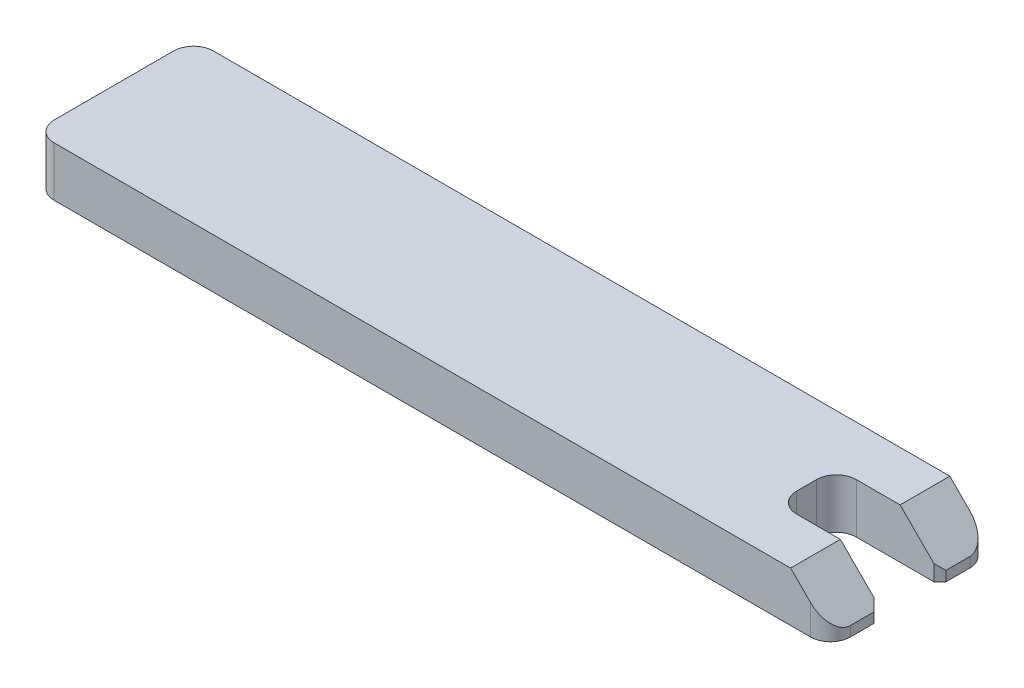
ISO-10303-21;
HEADER;
FILE_DESCRIPTION(('STEP AP214'),'2;1');
FILE_NAME('part.step','',(''),(''),'','','');
FILE_SCHEMA(('AUTOMOTIVE_DESIGN { 1 0 10303 214 1 1 1 1 }'));
ENDSEC;
DATA;
#1=APPLICATION_CONTEXT('core data for automotive mechanical design processes');
#2=APPLICATION_PROTOCOL_DEFINITION('international standard','automotive_design',2000,#1);
#3=PRODUCT_CONTEXT('',#1,'mechanical');
#4=PRODUCT('Part','Part','',(#3));
#5=PRODUCT_RELATED_PRODUCT_CATEGORY('part','',(#4));
#6=PRODUCT_DEFINITION_FORMATION('','',#4);
#7=PRODUCT_DEFINITION_CONTEXT('part definition',#1,'design');
#8=PRODUCT_DEFINITION('design','',#6,#7);
#9=PRODUCT_DEFINITION_SHAPE('','',#8);
#10=(LENGTH_UNIT() NAMED_UNIT(*) SI_UNIT(.MILLI.,.METRE.));
#11=(NAMED_UNIT(*) PLANE_ANGLE_UNIT() SI_UNIT($,.RADIAN.));
#12=(NAMED_UNIT(*) SI_UNIT($,.STERADIAN.) SOLID_ANGLE_UNIT());
#13=UNCERTAINTY_MEASURE_WITH_UNIT(LENGTH_MEASURE(1.E-05),#10,'distance_accuracy_value','');
#14=(GEOMETRIC_REPRESENTATION_CONTEXT(3) GLOBAL_UNCERTAINTY_ASSIGNED_CONTEXT((#13)) GLOBAL_UNIT_ASSIGNED_CONTEXT((#10,
#11,#12)) REPRESENTATION_CONTEXT('',''));
#15=CARTESIAN_POINT('',(0.,0.,0.));
#16=DIRECTION('',(0.,0.,1.));
#17=DIRECTION('',(1.,0.,0.));
#18=AXIS2_PLACEMENT_3D('',#15,#16,#17);
#19=CARTESIAN_POINT('',(-2.6,1.25,-1.5));
#20=DIRECTION('',(-1.,0.,0.));
#21=DIRECTION('',(0.,0.,1.));
#22=AXIS2_PLACEMENT_3D('',#19,#20,#21);
#23=PLANE('',#22);
#24=DIRECTION('',(0.,0.,-1.));
#25=VECTOR('',#24,1.);
#26=CARTESIAN_POINT('',(-2.6,1.25,-1.5));
#27=LINE('',#26,#25);
#28=CARTESIAN_POINT('',(-2.6,1.25,0.5));
#29=VERTEX_POINT('',#28);
#30=CARTESIAN_POINT('',(-2.6,1.25,-0.5));
#31=VERTEX_POINT('',#30);
#32=EDGE_CURVE('E183',#29,#31,#27,.T.);
#33=ORIENTED_EDGE('',*,*,#32,.F.);
#34=DIRECTION('',(0.,-1.,0.));
#35=VECTOR('',#34,1.);
#36=CARTESIAN_POINT('',(-2.6,-1.25,0.5));
#37=LINE('',#36,#35);
#38=CARTESIAN_POINT('',(-2.6,-1.25,0.5));
#39=VERTEX_POINT('',#38);
#40=EDGE_CURVE('E206',#29,#39,#37,.T.);
#41=ORIENTED_EDGE('',*,*,#40,.T.);
#42=DIRECTION('',(0.,0.,-1.));
#43=VECTOR('',#42,1.);
#44=CARTESIAN_POINT('',(-2.6,-1.25,-1.5));
#45=LINE('',#44,#43);
#46=CARTESIAN_POINT('',(-2.6,-1.25,-0.5));
#47=VERTEX_POINT('',#46);
#48=EDGE_CURVE('E301',#39,#47,#45,.T.);
#49=ORIENTED_EDGE('',*,*,#48,.T.);
#50=DIRECTION('',(0.,-1.,0.));
#51=VECTOR('',#50,1.);
#52=CARTESIAN_POINT('',(-2.6,1.25,-0.5));
#53=LINE('',#52,#51);
#54=EDGE_CURVE('E204',#47,#31,#53,.F.);
#55=ORIENTED_EDGE('',*,*,#54,.T.);
#56=EDGE_LOOP('',(#33,#41,#49,#55));
#57=FACE_BOUND('',#56,.T.);
#58=ADVANCED_FACE('F35',(#57),#23,.F.);
#59=CARTESIAN_POINT('',(-2.6,1.25,-1.5));
#60=DIRECTION('',(0.,0.,-1.));
#61=DIRECTION('',(-1.,0.,0.));
#62=AXIS2_PLACEMENT_3D('',#59,#60,#61);
#63=PLANE('',#62);
#64=DIRECTION('',(1.,0.,0.));
#65=VECTOR('',#64,1.);
#66=CARTESIAN_POINT('',(-2.6,-1.25,-1.5));
#67=LINE('',#66,#65);
#68=CARTESIAN_POINT('',(-1.6,-1.25,-1.5));
#69=VERTEX_POINT('',#68);
#70=CARTESIAN_POINT('',(2.3,-1.25,-1.5));
#71=VERTEX_POINT('',#70);
#72=EDGE_CURVE('E299',#69,#71,#67,.T.);
#73=ORIENTED_EDGE('',*,*,#72,.T.);
#74=DIRECTION('',(0.,1.,0.));
#75=VECTOR('',#74,1.);
#76=CARTESIAN_POINT('',(2.3,1.25,-1.5));
#77=LINE('',#76,#75);
#78=CARTESIAN_POINT('',(2.3,-0.450000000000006,-1.5));
#79=VERTEX_POINT('',#78);
#80=EDGE_CURVE('E166',#71,#79,#77,.T.);
#81=ORIENTED_EDGE('',*,*,#80,.T.);
#82=DIRECTION('',(-0.707106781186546,0.707106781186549,0.));
#83=VECTOR('',#82,1.);
#84=CARTESIAN_POINT('',(0.600000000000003,1.25,-1.5));
#85=LINE('',#84,#83);
#86=CARTESIAN_POINT('',(0.600000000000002,1.25,-1.5));
#87=VERTEX_POINT('',#86);
#88=EDGE_CURVE('E158',#79,#87,#85,.T.);
#89=ORIENTED_EDGE('',*,*,#88,.T.);
#90=DIRECTION('',(1.,0.,0.));
#91=VECTOR('',#90,1.);
#92=CARTESIAN_POINT('',(-2.6,1.25,-1.5));
#93=LINE('',#92,#91);
#94=CARTESIAN_POINT('',(-1.6,1.25,-1.5));
#95=VERTEX_POINT('',#94);
#96=EDGE_CURVE('E163',#95,#87,#93,.T.);
#97=ORIENTED_EDGE('',*,*,#96,.F.);
#98=DIRECTION('',(0.,-1.,0.));
#99=VECTOR('',#98,1.);
#100=CARTESIAN_POINT('',(-1.6,-1.25,-1.5));
#101=LINE('',#100,#99);
#102=EDGE_CURVE('E211',#95,#69,#101,.T.);
#103=ORIENTED_EDGE('',*,*,#102,.T.);
#104=EDGE_LOOP('',(#73,#81,#89,#97,#103));
#105=FACE_BOUND('',#104,.T.);
#106=ADVANCED_FACE('F161',(#105),#63,.F.);
#107=CARTESIAN_POINT('',(2.6,1.25,-1.5));
#108=DIRECTION('',(-1.,0.,0.));
#109=DIRECTION('',(0.,0.,1.));
#110=AXIS2_PLACEMENT_3D('',#107,#108,#109);
#111=PLANE('',#110);
#112=DIRECTION('',(0.,0.,1.));
#113=VECTOR('',#112,1.);
#114=CARTESIAN_POINT('',(2.6,-0.750000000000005,-1.5));
#115=LINE('',#114,#113);
#116=CARTESIAN_POINT('',(2.6,-0.750000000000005,-3.));
#117=VERTEX_POINT('',#116);
#118=CARTESIAN_POINT('',(2.6,-0.750000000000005,-1.8));
#119=VERTEX_POINT('',#118);
#120=EDGE_CURVE('E171',#117,#119,#115,.T.);
#121=ORIENTED_EDGE('',*,*,#120,.T.);
#122=DIRECTION('',(0.,-1.,0.));
#123=VECTOR('',#122,1.);
#124=CARTESIAN_POINT('',(2.6,1.25,-1.8));
#125=LINE('',#124,#123);
#126=CARTESIAN_POINT('',(2.6,-1.25,-1.8));
#127=VERTEX_POINT('',#126);
#128=EDGE_CURVE('E259',#119,#127,#125,.T.);
#129=ORIENTED_EDGE('',*,*,#128,.T.);
#130=DIRECTION('',(0.,0.,-1.));
#131=VECTOR('',#130,1.);
#132=CARTESIAN_POINT('',(2.6,-1.25,-1.5));
#133=LINE('',#132,#131);
#134=CARTESIAN_POINT('',(2.6,-1.25,-3.));
#135=VERTEX_POINT('',#134);
#136=EDGE_CURVE('E297',#127,#135,#133,.T.);
#137=ORIENTED_EDGE('',*,*,#136,.T.);
#138=DIRECTION('',(0.,-1.,0.));
#139=VECTOR('',#138,1.);
#140=CARTESIAN_POINT('',(2.6,1.25,-3.));
#141=LINE('',#140,#139);
#142=EDGE_CURVE('E227',#135,#117,#141,.F.);
#143=ORIENTED_EDGE('',*,*,#142,.T.);
#144=EDGE_LOOP('',(#121,#129,#137,#143));
#145=FACE_BOUND('',#144,.T.);
#146=ADVANCED_FACE('F348',(#145),#111,.F.);
#147=CARTESIAN_POINT('',(2.6,1.25,-3.99999999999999));
#148=DIRECTION('',(0.,0.,1.));
#149=DIRECTION('',(1.,0.,0.));
#150=AXIS2_PLACEMENT_3D('',#147,#148,#149);
#151=PLANE('',#150);
#152=DIRECTION('',(0.707106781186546,-0.707106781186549,0.));
#153=VECTOR('',#152,1.);
#154=CARTESIAN_POINT('',(0.600000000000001,1.25,-3.99999999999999));
#155=LINE('',#154,#153);
#156=CARTESIAN_POINT('',(0.599999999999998,1.25,-3.99999999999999));
#157=VERTEX_POINT('',#156);
#158=CARTESIAN_POINT('',(1.6,0.249999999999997,-3.99999999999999));
#159=VERTEX_POINT('',#158);
#160=EDGE_CURVE('E187',#157,#159,#155,.T.);
#161=ORIENTED_EDGE('',*,*,#160,.T.);
#162=DIRECTION('',(0.,-1.,0.));
#163=VECTOR('',#162,1.);
#164=CARTESIAN_POINT('',(1.6,1.25,-3.99999999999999));
#165=LINE('',#164,#163);
#166=CARTESIAN_POINT('',(1.6,-1.25,-3.99999999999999));
#167=VERTEX_POINT('',#166);
#168=EDGE_CURVE('E215',#159,#167,#165,.T.);
#169=ORIENTED_EDGE('',*,*,#168,.T.);
#170=DIRECTION('',(-1.,0.,0.));
#171=VECTOR('',#170,1.);
#172=CARTESIAN_POINT('',(2.6,-1.25,-3.99999999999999));
#173=LINE('',#172,#171);
#174=CARTESIAN_POINT('',(-36.4,-1.25,-4.));
#175=VERTEX_POINT('',#174);
#176=EDGE_CURVE('E294',#167,#175,#173,.T.);
#177=ORIENTED_EDGE('',*,*,#176,.T.);
#178=DIRECTION('',(0.,-1.,0.));
#179=VECTOR('',#178,1.);
#180=CARTESIAN_POINT('',(-36.4,1.25,-4.));
#181=LINE('',#180,#179);
#182=CARTESIAN_POINT('',(-36.4,1.25,-4.));
#183=VERTEX_POINT('',#182);
#184=EDGE_CURVE('E213',#175,#183,#181,.F.);
#185=ORIENTED_EDGE('',*,*,#184,.T.);
#186=DIRECTION('',(-1.,0.,0.));
#187=VECTOR('',#186,1.);
#188=CARTESIAN_POINT('',(2.6,1.25,-3.99999999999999));
#189=LINE('',#188,#187);
#190=EDGE_CURVE('E182',#157,#183,#189,.T.);
#191=ORIENTED_EDGE('',*,*,#190,.F.);
#192=EDGE_LOOP('',(#161,#169,#177,#185,#191));
#193=FACE_BOUND('',#192,.T.);
#194=ADVANCED_FACE('F355',(#193),#151,.F.);
#195=CARTESIAN_POINT('',(-37.4,1.25,-4.));
#196=DIRECTION('',(1.,0.,0.));
#197=DIRECTION('',(0.,0.,-1.));
#198=AXIS2_PLACEMENT_3D('',#195,#196,#197);
#199=PLANE('',#198);
#200=DIRECTION('',(0.,0.,1.));
#201=VECTOR('',#200,1.);
#202=CARTESIAN_POINT('',(-37.4,1.25,-4.));
#203=LINE('',#202,#201);
#204=CARTESIAN_POINT('',(-37.4,1.25,-3.));
#205=VERTEX_POINT('',#204);
#206=CARTESIAN_POINT('',(-37.4,1.25,3.));
#207=VERTEX_POINT('',#206);
#208=EDGE_CURVE('E308',#205,#207,#203,.T.);
#209=ORIENTED_EDGE('',*,*,#208,.F.);
#210=DIRECTION('',(0.,-1.,0.));
#211=VECTOR('',#210,1.);
#212=CARTESIAN_POINT('',(-37.4,1.25,-3.));
#213=LINE('',#212,#211);
#214=CARTESIAN_POINT('',(-37.4,-1.25,-3.));
#215=VERTEX_POINT('',#214);
#216=EDGE_CURVE('E244',#205,#215,#213,.T.);
#217=ORIENTED_EDGE('',*,*,#216,.T.);
#218=DIRECTION('',(0.,0.,1.));
#219=VECTOR('',#218,1.);
#220=CARTESIAN_POINT('',(-37.4,-1.25,-4.));
#221=LINE('',#220,#219);
#222=CARTESIAN_POINT('',(-37.4,-1.25,3.));
#223=VERTEX_POINT('',#222);
#224=EDGE_CURVE('E291',#215,#223,#221,.T.);
#225=ORIENTED_EDGE('',*,*,#224,.T.);
#226=DIRECTION('',(0.,-1.,0.));
#227=VECTOR('',#226,1.);
#228=CARTESIAN_POINT('',(-37.4,1.25,3.));
#229=LINE('',#228,#227);
#230=EDGE_CURVE('E242',#223,#207,#229,.F.);
#231=ORIENTED_EDGE('',*,*,#230,.T.);
#232=EDGE_LOOP('',(#209,#217,#225,#231));
#233=FACE_BOUND('',#232,.T.);
#234=ADVANCED_FACE('F320',(#233),#199,.F.);
#235=CARTESIAN_POINT('',(2.6,1.25,3.99999999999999));
#236=DIRECTION('',(0.,0.,-1.));
#237=DIRECTION('',(-1.,0.,0.));
#238=AXIS2_PLACEMENT_3D('',#235,#236,#237);
#239=PLANE('',#238);
#240=DIRECTION('',(1.,0.,0.));
#241=VECTOR('',#240,1.);
#242=CARTESIAN_POINT('',(2.6,-1.25,3.99999999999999));
#243=LINE('',#242,#241);
#244=CARTESIAN_POINT('',(-36.4,-1.25,4.));
#245=VERTEX_POINT('',#244);
#246=CARTESIAN_POINT('',(1.6,-1.25,3.99999999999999));
#247=VERTEX_POINT('',#246);
#248=EDGE_CURVE('E286',#245,#247,#243,.T.);
#249=ORIENTED_EDGE('',*,*,#248,.T.);
#250=DIRECTION('',(0.,-1.,0.));
#251=VECTOR('',#250,1.);
#252=CARTESIAN_POINT('',(1.6,1.25,3.99999999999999));
#253=LINE('',#252,#251);
#254=CARTESIAN_POINT('',(1.6,0.249999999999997,3.99999999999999));
#255=VERTEX_POINT('',#254);
#256=EDGE_CURVE('E237',#247,#255,#253,.F.);
#257=ORIENTED_EDGE('',*,*,#256,.T.);
#258=DIRECTION('',(-0.707106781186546,0.707106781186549,0.));
#259=VECTOR('',#258,1.);
#260=CARTESIAN_POINT('',(0.600000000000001,1.25,3.99999999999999));
#261=LINE('',#260,#259);
#262=CARTESIAN_POINT('',(0.599999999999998,1.25,3.99999999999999));
#263=VERTEX_POINT('',#262);
#264=EDGE_CURVE('E201',#255,#263,#261,.T.);
#265=ORIENTED_EDGE('',*,*,#264,.T.);
#266=DIRECTION('',(1.,0.,0.));
#267=VECTOR('',#266,1.);
#268=CARTESIAN_POINT('',(2.6,1.25,3.99999999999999));
#269=LINE('',#268,#267);
#270=CARTESIAN_POINT('',(-36.4,1.25,4.));
#271=VERTEX_POINT('',#270);
#272=EDGE_CURVE('E306',#271,#263,#269,.T.);
#273=ORIENTED_EDGE('',*,*,#272,.F.);
#274=DIRECTION('',(0.,-1.,0.));
#275=VECTOR('',#274,1.);
#276=CARTESIAN_POINT('',(-36.4,1.25,4.));
#277=LINE('',#276,#275);
#278=EDGE_CURVE('E234',#271,#245,#277,.T.);
#279=ORIENTED_EDGE('',*,*,#278,.T.);
#280=EDGE_LOOP('',(#249,#257,#265,#273,#279));
#281=FACE_BOUND('',#280,.T.);
#282=ADVANCED_FACE('F330',(#281),#239,.F.);
#283=CARTESIAN_POINT('',(2.6,1.25,1.5));
#284=DIRECTION('',(-1.,0.,0.));
#285=DIRECTION('',(0.,0.,1.));
#286=AXIS2_PLACEMENT_3D('',#283,#284,#285);
#287=PLANE('',#286);
#288=DIRECTION('',(0.,0.,-1.));
#289=VECTOR('',#288,1.);
#290=CARTESIAN_POINT('',(2.6,-1.25,1.5));
#291=LINE('',#290,#289);
#292=CARTESIAN_POINT('',(2.6,-1.25,3.));
#293=VERTEX_POINT('',#292);
#294=CARTESIAN_POINT('',(2.6,-1.25,1.79999999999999));
#295=VERTEX_POINT('',#294);
#296=EDGE_CURVE('E284',#293,#295,#291,.T.);
#297=ORIENTED_EDGE('',*,*,#296,.T.);
#298=DIRECTION('',(0.,1.,0.));
#299=VECTOR('',#298,1.);
#300=CARTESIAN_POINT('',(2.6,1.25,1.79999999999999));
#301=LINE('',#300,#299);
#302=CARTESIAN_POINT('',(2.6,-0.750000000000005,1.79999999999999));
#303=VERTEX_POINT('',#302);
#304=EDGE_CURVE('E43',#295,#303,#301,.T.);
#305=ORIENTED_EDGE('',*,*,#304,.T.);
#306=DIRECTION('',(0.,0.,1.));
#307=VECTOR('',#306,1.);
#308=CARTESIAN_POINT('',(2.6,-0.750000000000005,3.99999999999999));
#309=LINE('',#308,#307);
#310=CARTESIAN_POINT('',(2.6,-0.750000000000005,3.));
#311=VERTEX_POINT('',#310);
#312=EDGE_CURVE('E199',#303,#311,#309,.T.);
#313=ORIENTED_EDGE('',*,*,#312,.T.);
#314=DIRECTION('',(0.,-1.,0.));
#315=VECTOR('',#314,1.);
#316=CARTESIAN_POINT('',(2.6,1.25,3.));
#317=LINE('',#316,#315);
#318=EDGE_CURVE('E231',#311,#293,#317,.T.);
#319=ORIENTED_EDGE('',*,*,#318,.T.);
#320=EDGE_LOOP('',(#297,#305,#313,#319));
#321=FACE_BOUND('',#320,.T.);
#322=ADVANCED_FACE('F432',(#321),#287,.F.);
#323=CARTESIAN_POINT('',(-2.6,1.25,1.5));
#324=DIRECTION('',(0.,0.,1.));
#325=DIRECTION('',(1.,0.,0.));
#326=AXIS2_PLACEMENT_3D('',#323,#324,#325);
#327=PLANE('',#326);
#328=DIRECTION('',(0.707106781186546,-0.707106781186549,0.));
#329=VECTOR('',#328,1.);
#330=CARTESIAN_POINT('',(0.600000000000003,1.25,1.5));
#331=LINE('',#330,#329);
#332=CARTESIAN_POINT('',(0.600000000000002,1.25,1.5));
#333=VERTEX_POINT('',#332);
#334=CARTESIAN_POINT('',(2.30000000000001,-0.450000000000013,1.5));
#335=VERTEX_POINT('',#334);
#336=EDGE_CURVE('E170',#333,#335,#331,.T.);
#337=ORIENTED_EDGE('',*,*,#336,.T.);
#338=DIRECTION('',(0.,-1.,0.));
#339=VECTOR('',#338,1.);
#340=CARTESIAN_POINT('',(2.30000000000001,1.25,1.5));
#341=LINE('',#340,#339);
#342=CARTESIAN_POINT('',(2.30000000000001,-1.25,1.5));
#343=VERTEX_POINT('',#342);
#344=EDGE_CURVE('E269',#335,#343,#341,.T.);
#345=ORIENTED_EDGE('',*,*,#344,.T.);
#346=DIRECTION('',(-1.,0.,0.));
#347=VECTOR('',#346,1.);
#348=CARTESIAN_POINT('',(-2.6,-1.25,1.5));
#349=LINE('',#348,#347);
#350=CARTESIAN_POINT('',(-1.6,-1.25,1.5));
#351=VERTEX_POINT('',#350);
#352=EDGE_CURVE('E275',#343,#351,#349,.T.);
#353=ORIENTED_EDGE('',*,*,#352,.T.);
#354=DIRECTION('',(0.,-1.,0.));
#355=VECTOR('',#354,1.);
#356=CARTESIAN_POINT('',(-1.6,1.25,1.5));
#357=LINE('',#356,#355);
#358=CARTESIAN_POINT('',(-1.6,1.25,1.5));
#359=VERTEX_POINT('',#358);
#360=EDGE_CURVE('E209',#351,#359,#357,.F.);
#361=ORIENTED_EDGE('',*,*,#360,.T.);
#362=DIRECTION('',(-1.,0.,0.));
#363=VECTOR('',#362,1.);
#364=CARTESIAN_POINT('',(-2.6,1.25,1.5));
#365=LINE('',#364,#363);
#366=EDGE_CURVE('E192',#333,#359,#365,.T.);
#367=ORIENTED_EDGE('',*,*,#366,.F.);
#368=EDGE_LOOP('',(#337,#345,#353,#361,#367));
#369=FACE_BOUND('',#368,.T.);
#370=ADVANCED_FACE('F274',(#369),#327,.F.);
#371=CARTESIAN_POINT('',(0.,1.25,0.));
#372=DIRECTION('',(0.,1.,0.));
#373=DIRECTION('',(0.,0.,1.));
#374=AXIS2_PLACEMENT_3D('',#371,#372,#373);
#375=PLANE('',#374);
#376=ORIENTED_EDGE('',*,*,#190,.T.);
#377=CARTESIAN_POINT('',(-36.4,1.25,-3.));
#378=DIRECTION('',(0.,1.,0.));
#379=DIRECTION('',(0.,0.,1.));
#380=AXIS2_PLACEMENT_3D('',#377,#378,#379);
#381=CIRCLE('',#380,1.);
#382=EDGE_CURVE('E249',#183,#205,#381,.T.);
#383=ORIENTED_EDGE('',*,*,#382,.T.);
#384=ORIENTED_EDGE('',*,*,#208,.T.);
#385=CARTESIAN_POINT('',(-36.4,1.25,3.));
#386=DIRECTION('',(0.,1.,0.));
#387=DIRECTION('',(0.,0.,1.));
#388=AXIS2_PLACEMENT_3D('',#385,#386,#387);
#389=CIRCLE('',#388,1.);
#390=EDGE_CURVE('E247',#207,#271,#389,.T.);
#391=ORIENTED_EDGE('',*,*,#390,.T.);
#392=ORIENTED_EDGE('',*,*,#272,.T.);
#393=DIRECTION('',(0.,0.,-1.));
#394=VECTOR('',#393,1.);
#395=CARTESIAN_POINT('',(0.600000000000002,1.25,1.5));
#396=LINE('',#395,#394);
#397=EDGE_CURVE('E188',#263,#333,#396,.T.);
#398=ORIENTED_EDGE('',*,*,#397,.T.);
#399=ORIENTED_EDGE('',*,*,#366,.T.);
#400=CARTESIAN_POINT('',(-1.6,1.25,0.5));
#401=DIRECTION('',(0.,1.,0.));
#402=DIRECTION('',(0.,0.,1.));
#403=AXIS2_PLACEMENT_3D('',#400,#401,#402);
#404=CIRCLE('',#403,1.);
#405=EDGE_CURVE('E254',#359,#29,#404,.F.);
#406=ORIENTED_EDGE('',*,*,#405,.T.);
#407=ORIENTED_EDGE('',*,*,#32,.T.);
#408=CARTESIAN_POINT('',(-1.6,1.25,-0.5));
#409=DIRECTION('',(0.,1.,0.));
#410=DIRECTION('',(0.,0.,1.));
#411=AXIS2_PLACEMENT_3D('',#408,#409,#410);
#412=CIRCLE('',#411,1.);
#413=EDGE_CURVE('E181',#31,#95,#412,.F.);
#414=ORIENTED_EDGE('',*,*,#413,.T.);
#415=ORIENTED_EDGE('',*,*,#96,.T.);
#416=DIRECTION('',(0.,0.,-1.));
#417=VECTOR('',#416,1.);
#418=CARTESIAN_POINT('',(0.599999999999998,1.25,-3.99999999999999));
#419=LINE('',#418,#417);
#420=EDGE_CURVE('E177',#87,#157,#419,.T.);
#421=ORIENTED_EDGE('',*,*,#420,.T.);
#422=EDGE_LOOP('',(#376,#383,#384,#391,#392,#398,#399,#406,#407,#414,#415,#421));
#423=FACE_BOUND('',#422,.T.);
#424=ADVANCED_FACE('F176',(#423),#375,.T.);
#425=CARTESIAN_POINT('',(0.,-1.25,0.));
#426=DIRECTION('',(0.,1.,0.));
#427=DIRECTION('',(0.,0.,1.));
#428=AXIS2_PLACEMENT_3D('',#425,#426,#427);
#429=PLANE('',#428);
#430=ORIENTED_EDGE('',*,*,#136,.F.);
#431=DIRECTION('',(0.707106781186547,0.,-0.707106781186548));
#432=VECTOR('',#431,1.);
#433=CARTESIAN_POINT('',(2.6,-1.25,-1.8));
#434=LINE('',#433,#432);
#435=EDGE_CURVE('E264',#127,#71,#434,.F.);
#436=ORIENTED_EDGE('',*,*,#435,.T.);
#437=ORIENTED_EDGE('',*,*,#72,.F.);
#438=CARTESIAN_POINT('',(-1.6,-1.25,-0.5));
#439=DIRECTION('',(0.,1.,0.));
#440=DIRECTION('',(0.,0.,1.));
#441=AXIS2_PLACEMENT_3D('',#438,#439,#440);
#442=CIRCLE('',#441,1.);
#443=EDGE_CURVE('E256',#69,#47,#442,.T.);
#444=ORIENTED_EDGE('',*,*,#443,.T.);
#445=ORIENTED_EDGE('',*,*,#48,.F.);
#446=CARTESIAN_POINT('',(-1.6,-1.25,0.5));
#447=DIRECTION('',(0.,1.,0.));
#448=DIRECTION('',(0.,0.,1.));
#449=AXIS2_PLACEMENT_3D('',#446,#447,#448);
#450=CIRCLE('',#449,1.);
#451=EDGE_CURVE('E251',#39,#351,#450,.T.);
#452=ORIENTED_EDGE('',*,*,#451,.T.);
#453=ORIENTED_EDGE('',*,*,#352,.F.);
#454=DIRECTION('',(-0.707106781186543,0.,-0.707106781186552));
#455=VECTOR('',#454,1.);
#456=CARTESIAN_POINT('',(2.30000000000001,-1.25,1.5));
#457=LINE('',#456,#455);
#458=EDGE_CURVE('E262',#343,#295,#457,.F.);
#459=ORIENTED_EDGE('',*,*,#458,.T.);
#460=ORIENTED_EDGE('',*,*,#296,.F.);
#461=CARTESIAN_POINT('',(1.6,-1.25,2.99999999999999));
#462=DIRECTION('',(0.,1.,0.));
#463=DIRECTION('',(0.,0.,1.));
#464=AXIS2_PLACEMENT_3D('',#461,#462,#463);
#465=CIRCLE('',#464,1.);
#466=EDGE_CURVE('E222',#293,#247,#465,.F.);
#467=ORIENTED_EDGE('',*,*,#466,.T.);
#468=ORIENTED_EDGE('',*,*,#248,.F.);
#469=CARTESIAN_POINT('',(-36.4,-1.25,3.));
#470=DIRECTION('',(0.,1.,0.));
#471=DIRECTION('',(0.,0.,1.));
#472=AXIS2_PLACEMENT_3D('',#469,#470,#471);
#473=CIRCLE('',#472,1.);
#474=EDGE_CURVE('E218',#245,#223,#473,.F.);
#475=ORIENTED_EDGE('',*,*,#474,.T.);
#476=ORIENTED_EDGE('',*,*,#224,.F.);
#477=CARTESIAN_POINT('',(-36.4,-1.25,-3.));
#478=DIRECTION('',(0.,1.,0.));
#479=DIRECTION('',(0.,0.,1.));
#480=AXIS2_PLACEMENT_3D('',#477,#478,#479);
#481=CIRCLE('',#480,1.);
#482=EDGE_CURVE('E220',#215,#175,#481,.F.);
#483=ORIENTED_EDGE('',*,*,#482,.T.);
#484=ORIENTED_EDGE('',*,*,#176,.F.);
#485=CARTESIAN_POINT('',(1.6,-1.25,-2.99999999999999));
#486=DIRECTION('',(0.,1.,0.));
#487=DIRECTION('',(0.,0.,1.));
#488=AXIS2_PLACEMENT_3D('',#485,#486,#487);
#489=CIRCLE('',#488,1.);
#490=EDGE_CURVE('E224',#167,#135,#489,.F.);
#491=ORIENTED_EDGE('',*,*,#490,.T.);
#492=EDGE_LOOP('',(#430,#436,#437,#444,#445,#452,#453,#459,#460,#467,#468,#475,#476,#483,#484,#491));
#493=FACE_BOUND('',#492,.T.);
#494=ADVANCED_FACE('F280',(#493),#429,.F.);
#495=CARTESIAN_POINT('',(0.600000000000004,1.25,0.));
#496=DIRECTION('',(0.707106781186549,0.707106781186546,0.));
#497=DIRECTION('',(0.,0.,1.));
#498=AXIS2_PLACEMENT_3D('',#495,#496,#497);
#499=PLANE('',#498);
#500=ORIENTED_EDGE('',*,*,#88,.F.);
#501=DIRECTION('',(-0.577350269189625,0.577350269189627,0.577350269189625));
#502=VECTOR('',#501,1.);
#503=CARTESIAN_POINT('',(0.666666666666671,1.18333333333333,0.133333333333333));
#504=LINE('',#503,#502);
#505=EDGE_CURVE('E267',#79,#119,#504,.F.);
#506=ORIENTED_EDGE('',*,*,#505,.T.);
#507=ORIENTED_EDGE('',*,*,#120,.F.);
#508=CARTESIAN_POINT('',(1.6,0.249999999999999,-2.99999999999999));
#509=DIRECTION('',(0.707106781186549,0.707106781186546,0.));
#510=DIRECTION('',(0.707106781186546,-0.707106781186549,0.));
#511=AXIS2_PLACEMENT_3D('',#508,#509,#510);
#512=ELLIPSE('',#511,1.4142135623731,1.);
#513=EDGE_CURVE('E229',#117,#159,#512,.T.);
#514=ORIENTED_EDGE('',*,*,#513,.T.);
#515=ORIENTED_EDGE('',*,*,#160,.F.);
#516=ORIENTED_EDGE('',*,*,#420,.F.);
#517=EDGE_LOOP('',(#500,#506,#507,#514,#515,#516));
#518=FACE_BOUND('',#517,.T.);
#519=ADVANCED_FACE('F185',(#518),#499,.T.);
#520=CARTESIAN_POINT('',(0.600000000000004,1.25,0.));
#521=DIRECTION('',(0.707106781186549,0.707106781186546,0.));
#522=DIRECTION('',(0.,0.,1.));
#523=AXIS2_PLACEMENT_3D('',#520,#521,#522);
#524=PLANE('',#523);
#525=ORIENTED_EDGE('',*,*,#312,.F.);
#526=DIRECTION('',(0.577350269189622,-0.577350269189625,0.57735026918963));
#527=VECTOR('',#526,1.);
#528=CARTESIAN_POINT('',(0.66666666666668,1.18333333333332,-0.13333333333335));
#529=LINE('',#528,#527);
#530=EDGE_CURVE('E11',#303,#335,#529,.F.);
#531=ORIENTED_EDGE('',*,*,#530,.T.);
#532=ORIENTED_EDGE('',*,*,#336,.F.);
#533=ORIENTED_EDGE('',*,*,#397,.F.);
#534=ORIENTED_EDGE('',*,*,#264,.F.);
#535=CARTESIAN_POINT('',(1.6,0.249999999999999,2.99999999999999));
#536=DIRECTION('',(0.707106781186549,0.707106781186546,0.));
#537=DIRECTION('',(0.707106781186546,-0.707106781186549,0.));
#538=AXIS2_PLACEMENT_3D('',#535,#536,#537);
#539=ELLIPSE('',#538,1.4142135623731,1.);
#540=EDGE_CURVE('E239',#255,#311,#539,.T.);
#541=ORIENTED_EDGE('',*,*,#540,.T.);
#542=EDGE_LOOP('',(#525,#531,#532,#533,#534,#541));
#543=FACE_BOUND('',#542,.T.);
#544=ADVANCED_FACE('F373',(#543),#524,.T.);
#545=CARTESIAN_POINT('',(-1.6,1.25,0.5));
#546=DIRECTION('',(0.,1.,0.));
#547=DIRECTION('',(0.,0.,1.));
#548=AXIS2_PLACEMENT_3D('',#545,#546,#547);
#549=CYLINDRICAL_SURFACE('',#548,1.);
#550=ORIENTED_EDGE('',*,*,#405,.F.);
#551=ORIENTED_EDGE('',*,*,#360,.F.);
#552=ORIENTED_EDGE('',*,*,#451,.F.);
#553=ORIENTED_EDGE('',*,*,#40,.F.);
#554=EDGE_LOOP('',(#550,#551,#552,#553));
#555=FACE_BOUND('',#554,.T.);
#556=ADVANCED_FACE('F336',(#555),#549,.F.);
#557=CARTESIAN_POINT('',(-1.6,1.25,-0.5));
#558=DIRECTION('',(0.,1.,0.));
#559=DIRECTION('',(0.,0.,1.));
#560=AXIS2_PLACEMENT_3D('',#557,#558,#559);
#561=CYLINDRICAL_SURFACE('',#560,1.);
#562=ORIENTED_EDGE('',*,*,#413,.F.);
#563=ORIENTED_EDGE('',*,*,#54,.F.);
#564=ORIENTED_EDGE('',*,*,#443,.F.);
#565=ORIENTED_EDGE('',*,*,#102,.F.);
#566=EDGE_LOOP('',(#562,#563,#564,#565));
#567=FACE_BOUND('',#566,.T.);
#568=ADVANCED_FACE('F342',(#567),#561,.F.);
#569=CARTESIAN_POINT('',(1.6,1.25,-2.99999999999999));
#570=DIRECTION('',(0.,-1.,0.));
#571=DIRECTION('',(0.,0.,-1.));
#572=AXIS2_PLACEMENT_3D('',#569,#570,#571);
#573=CYLINDRICAL_SURFACE('',#572,1.);
#574=ORIENTED_EDGE('',*,*,#513,.F.);
#575=ORIENTED_EDGE('',*,*,#142,.F.);
#576=ORIENTED_EDGE('',*,*,#490,.F.);
#577=ORIENTED_EDGE('',*,*,#168,.F.);
#578=EDGE_LOOP('',(#574,#575,#576,#577));
#579=FACE_BOUND('',#578,.T.);
#580=ADVANCED_FACE('F354',(#579),#573,.T.);
#581=CARTESIAN_POINT('',(1.6,1.25,2.99999999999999));
#582=DIRECTION('',(0.,-1.,0.));
#583=DIRECTION('',(0.,0.,-1.));
#584=AXIS2_PLACEMENT_3D('',#581,#582,#583);
#585=CYLINDRICAL_SURFACE('',#584,1.);
#586=ORIENTED_EDGE('',*,*,#540,.F.);
#587=ORIENTED_EDGE('',*,*,#256,.F.);
#588=ORIENTED_EDGE('',*,*,#466,.F.);
#589=ORIENTED_EDGE('',*,*,#318,.F.);
#590=EDGE_LOOP('',(#586,#587,#588,#589));
#591=FACE_BOUND('',#590,.T.);
#592=ADVANCED_FACE('F382',(#591),#585,.T.);
#593=CARTESIAN_POINT('',(-36.4,1.25,-3.));
#594=DIRECTION('',(0.,-1.,0.));
#595=DIRECTION('',(0.,0.,-1.));
#596=AXIS2_PLACEMENT_3D('',#593,#594,#595);
#597=CYLINDRICAL_SURFACE('',#596,1.);
#598=ORIENTED_EDGE('',*,*,#382,.F.);
#599=ORIENTED_EDGE('',*,*,#184,.F.);
#600=ORIENTED_EDGE('',*,*,#482,.F.);
#601=ORIENTED_EDGE('',*,*,#216,.F.);
#602=EDGE_LOOP('',(#598,#599,#600,#601));
#603=FACE_BOUND('',#602,.T.);
#604=ADVANCED_FACE('F317',(#603),#597,.T.);
#605=CARTESIAN_POINT('',(-36.4,1.25,3.));
#606=DIRECTION('',(0.,-1.,0.));
#607=DIRECTION('',(0.,0.,-1.));
#608=AXIS2_PLACEMENT_3D('',#605,#606,#607);
#609=CYLINDRICAL_SURFACE('',#608,1.);
#610=ORIENTED_EDGE('',*,*,#390,.F.);
#611=ORIENTED_EDGE('',*,*,#230,.F.);
#612=ORIENTED_EDGE('',*,*,#474,.F.);
#613=ORIENTED_EDGE('',*,*,#278,.F.);
#614=EDGE_LOOP('',(#610,#611,#612,#613));
#615=FACE_BOUND('',#614,.T.);
#616=ADVANCED_FACE('F327',(#615),#609,.T.);
#617=CARTESIAN_POINT('',(2.6,1.25,-1.8));
#618=DIRECTION('',(-0.707106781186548,0.,-0.707106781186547));
#619=DIRECTION('',(0.,-1.,0.));
#620=AXIS2_PLACEMENT_3D('',#617,#618,#619);
#621=PLANE('',#620);
#622=ORIENTED_EDGE('',*,*,#505,.F.);
#623=ORIENTED_EDGE('',*,*,#80,.F.);
#624=ORIENTED_EDGE('',*,*,#435,.F.);
#625=ORIENTED_EDGE('',*,*,#128,.F.);
#626=EDGE_LOOP('',(#622,#623,#624,#625));
#627=FACE_BOUND('',#626,.T.);
#628=ADVANCED_FACE('F346',(#627),#621,.F.);
#629=CARTESIAN_POINT('',(2.30000000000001,1.25,1.5));
#630=DIRECTION('',(-0.707106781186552,0.,0.707106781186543));
#631=DIRECTION('',(0.,-1.,0.));
#632=AXIS2_PLACEMENT_3D('',#629,#630,#631);
#633=PLANE('',#632);
#634=ORIENTED_EDGE('',*,*,#530,.F.);
#635=ORIENTED_EDGE('',*,*,#304,.F.);
#636=ORIENTED_EDGE('',*,*,#458,.F.);
#637=ORIENTED_EDGE('',*,*,#344,.F.);
#638=EDGE_LOOP('',(#634,#635,#636,#637));
#639=FACE_BOUND('',#638,.T.);
#640=ADVANCED_FACE('F37',(#639),#633,.F.);
#641=CLOSED_SHELL('',(#58,#106,#146,#194,#234,#282,#322,#370,#424,#494,#519,#544,#556,#568,#580,
#592,#604,#616,#628,#640));
#642=MANIFOLD_SOLID_BREP('B2',#641);
#643=ADVANCED_BREP_SHAPE_REPRESENTATION('',(#18,#642),#14);
#644=SHAPE_DEFINITION_REPRESENTATION(#9,#643);
ENDSEC;
END-ISO-10303-21;
